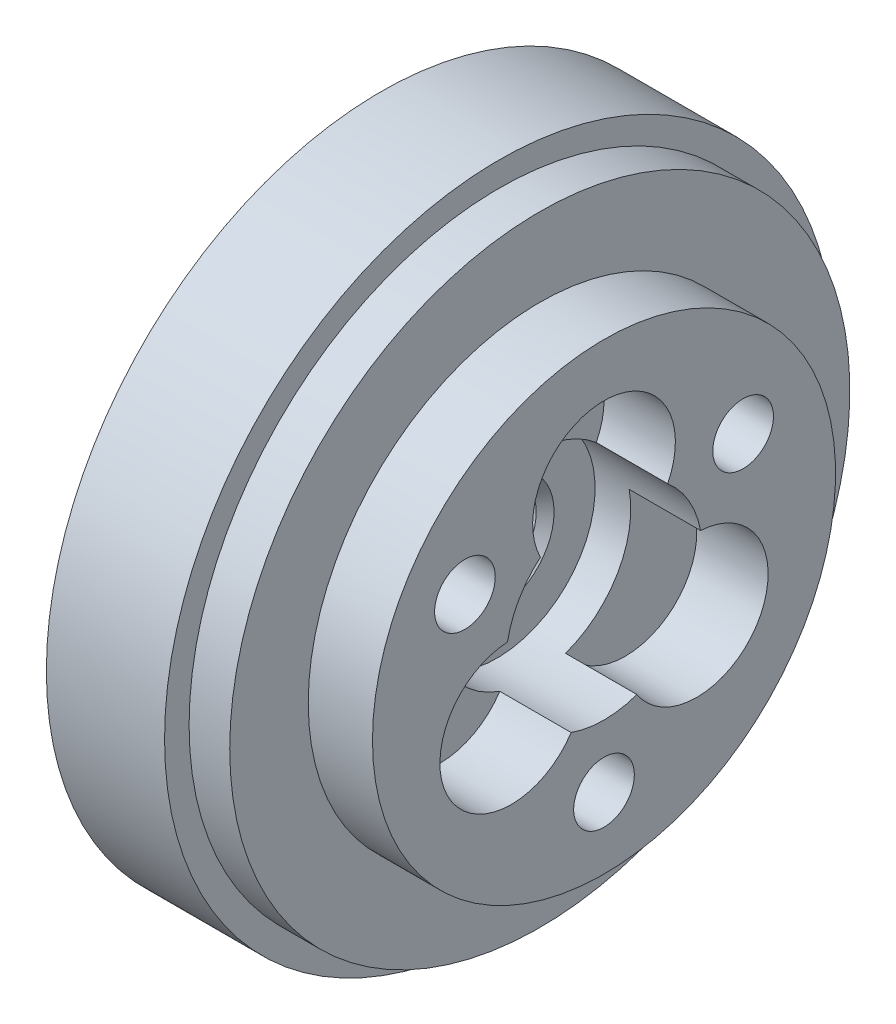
ISO-10303-21;
HEADER;
FILE_DESCRIPTION(('STEP AP214'),'2;1');
FILE_NAME('part.step','',(''),(''),'','','');
FILE_SCHEMA(('AUTOMOTIVE_DESIGN { 1 0 10303 214 1 1 1 1 }'));
ENDSEC;
DATA;
#1=APPLICATION_CONTEXT('core data for automotive mechanical design processes');
#2=APPLICATION_PROTOCOL_DEFINITION('international standard','automotive_design',2000,#1);
#3=PRODUCT_CONTEXT('',#1,'mechanical');
#4=PRODUCT('Part','Part','',(#3));
#5=PRODUCT_RELATED_PRODUCT_CATEGORY('part','',(#4));
#6=PRODUCT_DEFINITION_FORMATION('','',#4);
#7=PRODUCT_DEFINITION_CONTEXT('part definition',#1,'design');
#8=PRODUCT_DEFINITION('design','',#6,#7);
#9=PRODUCT_DEFINITION_SHAPE('','',#8);
#10=(LENGTH_UNIT() NAMED_UNIT(*) SI_UNIT(.MILLI.,.METRE.));
#11=(NAMED_UNIT(*) PLANE_ANGLE_UNIT() SI_UNIT($,.RADIAN.));
#12=(NAMED_UNIT(*) SI_UNIT($,.STERADIAN.) SOLID_ANGLE_UNIT());
#13=UNCERTAINTY_MEASURE_WITH_UNIT(LENGTH_MEASURE(1.E-05),#10,'distance_accuracy_value','');
#14=(GEOMETRIC_REPRESENTATION_CONTEXT(3) GLOBAL_UNCERTAINTY_ASSIGNED_CONTEXT((#13)) GLOBAL_UNIT_ASSIGNED_CONTEXT((#10,
#11,#12)) REPRESENTATION_CONTEXT('',''));
#15=CARTESIAN_POINT('',(0.,0.,0.));
#16=DIRECTION('',(0.,0.,1.));
#17=DIRECTION('',(1.,0.,0.));
#18=AXIS2_PLACEMENT_3D('',#15,#16,#17);
#19=CARTESIAN_POINT('',(0.,0.,0.));
#20=DIRECTION('',(1.,0.,0.));
#21=DIRECTION('',(0.,0.,-1.));
#22=AXIS2_PLACEMENT_3D('',#19,#20,#21);
#23=PLANE('',#22);
#24=CARTESIAN_POINT('',(0.,0.,0.));
#25=DIRECTION('',(1.,0.,0.));
#26=DIRECTION('',(0.,0.,-1.));
#27=AXIS2_PLACEMENT_3D('',#24,#25,#26);
#28=CIRCLE('',#27,2.21000000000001);
#29=CARTESIAN_POINT('',(0.,0.,-2.21000000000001));
#30=VERTEX_POINT('',#29);
#31=EDGE_CURVE('E166',#30,#30,#28,.T.);
#32=ORIENTED_EDGE('',*,*,#31,.T.);
#33=EDGE_LOOP('',(#32));
#34=FACE_BOUND('',#33,.T.);
#35=CARTESIAN_POINT('',(0.,0.,0.));
#36=DIRECTION('',(-1.,0.,0.));
#37=DIRECTION('',(0.,0.,1.));
#38=AXIS2_PLACEMENT_3D('',#35,#36,#37);
#39=CIRCLE('',#38,37.5);
#40=CARTESIAN_POINT('',(0.,0.,37.5));
#41=VERTEX_POINT('',#40);
#42=EDGE_CURVE('E154',#41,#41,#39,.T.);
#43=ORIENTED_EDGE('',*,*,#42,.T.);
#44=EDGE_LOOP('',(#43));
#45=FACE_BOUND('',#44,.T.);
#46=ADVANCED_FACE('F32',(#34,#45),#23,.F.);
#47=CARTESIAN_POINT('',(25.,25.95,0.));
#48=DIRECTION('',(-1.,0.,0.));
#49=DIRECTION('',(0.,0.,1.));
#50=AXIS2_PLACEMENT_3D('',#47,#48,#49);
#51=PLANE('',#50);
#52=CARTESIAN_POINT('',(25.,9.00000000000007,15.5884572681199));
#53=DIRECTION('',(1.,0.,0.));
#54=DIRECTION('',(0.,0.,-1.));
#55=AXIS2_PLACEMENT_3D('',#52,#53,#54);
#56=CIRCLE('',#55,3.4);
#57=CARTESIAN_POINT('',(25.,9.00000000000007,12.1884572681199));
#58=VERTEX_POINT('',#57);
#59=EDGE_CURVE('E100',#58,#58,#56,.T.);
#60=ORIENTED_EDGE('',*,*,#59,.F.);
#61=EDGE_LOOP('',(#60));
#62=FACE_BOUND('',#61,.T.);
#63=CARTESIAN_POINT('',(25.,8.99999999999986,-15.58845726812));
#64=DIRECTION('',(1.,0.,0.));
#65=DIRECTION('',(0.,0.,-1.));
#66=AXIS2_PLACEMENT_3D('',#63,#64,#65);
#67=CIRCLE('',#66,3.4);
#68=CARTESIAN_POINT('',(25.,8.99999999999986,-18.98845726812));
#69=VERTEX_POINT('',#68);
#70=EDGE_CURVE('E108',#69,#69,#67,.T.);
#71=ORIENTED_EDGE('',*,*,#70,.F.);
#72=EDGE_LOOP('',(#71));
#73=FACE_BOUND('',#72,.T.);
#74=CARTESIAN_POINT('',(25.,-18.,0.));
#75=DIRECTION('',(1.,0.,0.));
#76=DIRECTION('',(0.,0.,-1.));
#77=AXIS2_PLACEMENT_3D('',#74,#75,#76);
#78=CIRCLE('',#77,3.4);
#79=CARTESIAN_POINT('',(25.,-18.,-3.4));
#80=VERTEX_POINT('',#79);
#81=EDGE_CURVE('E114',#80,#80,#78,.T.);
#82=ORIENTED_EDGE('',*,*,#81,.F.);
#83=EDGE_LOOP('',(#82));
#84=FACE_BOUND('',#83,.T.);
#85=CARTESIAN_POINT('',(25.,0.,0.));
#86=DIRECTION('',(-1.,0.,0.));
#87=DIRECTION('',(0.,0.,1.));
#88=AXIS2_PLACEMENT_3D('',#85,#86,#87);
#89=CIRCLE('',#88,25.95);
#90=CARTESIAN_POINT('',(25.,0.,25.95));
#91=VERTEX_POINT('',#90);
#92=EDGE_CURVE('E139',#91,#91,#89,.T.);
#93=ORIENTED_EDGE('',*,*,#92,.F.);
#94=EDGE_LOOP('',(#93));
#95=FACE_BOUND('',#94,.T.);
#96=CARTESIAN_POINT('',(25.,0.,0.));
#97=DIRECTION('',(-1.,0.,0.));
#98=DIRECTION('',(0.,0.,1.));
#99=AXIS2_PLACEMENT_3D('',#96,#97,#98);
#100=CIRCLE('',#99,11.);
#101=CARTESIAN_POINT('',(25.,-10.3636259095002,-3.68717480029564));
#102=VERTEX_POINT('',#101);
#103=CARTESIAN_POINT('',(25.,-10.3636259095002,3.68717480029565));
#104=VERTEX_POINT('',#103);
#105=EDGE_CURVE('E133',#102,#104,#100,.T.);
#106=ORIENTED_EDGE('',*,*,#105,.T.);
#107=CARTESIAN_POINT('',(25.,-6.00000000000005,10.3923048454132));
#108=DIRECTION('',(1.,0.,0.));
#109=DIRECTION('',(0.,0.,-1.));
#110=AXIS2_PLACEMENT_3D('',#107,#108,#109);
#111=CIRCLE('',#110,8.);
#112=CARTESIAN_POINT('',(25.,1.98862590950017,10.8187507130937));
#113=VERTEX_POINT('',#112);
#114=EDGE_CURVE('E117',#113,#104,#111,.T.);
#115=ORIENTED_EDGE('',*,*,#114,.F.);
#116=CARTESIAN_POINT('',(25.,8.375,7.13157591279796));
#117=VERTEX_POINT('',#116);
#118=EDGE_CURVE('E126',#113,#117,#100,.T.);
#119=ORIENTED_EDGE('',*,*,#118,.T.);
#120=CARTESIAN_POINT('',(25.,12.,0.));
#121=DIRECTION('',(1.,0.,0.));
#122=DIRECTION('',(0.,0.,-1.));
#123=AXIS2_PLACEMENT_3D('',#120,#121,#122);
#124=CIRCLE('',#123,8.);
#125=CARTESIAN_POINT('',(25.,8.375,-7.13157591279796));
#126=VERTEX_POINT('',#125);
#127=EDGE_CURVE('E122',#126,#117,#124,.T.);
#128=ORIENTED_EDGE('',*,*,#127,.F.);
#129=CARTESIAN_POINT('',(25.,1.98862590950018,-10.8187507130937));
#130=VERTEX_POINT('',#129);
#131=EDGE_CURVE('E129',#126,#130,#100,.T.);
#132=ORIENTED_EDGE('',*,*,#131,.T.);
#133=CARTESIAN_POINT('',(25.,-6.00000000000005,-10.3923048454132));
#134=DIRECTION('',(1.,0.,0.));
#135=DIRECTION('',(0.,0.,-1.));
#136=AXIS2_PLACEMENT_3D('',#133,#134,#135);
#137=CIRCLE('',#136,8.00000000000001);
#138=EDGE_CURVE('E119',#102,#130,#137,.T.);
#139=ORIENTED_EDGE('',*,*,#138,.F.);
#140=EDGE_LOOP('',(#106,#115,#119,#128,#132,#139));
#141=FACE_BOUND('',#140,.T.);
#142=ADVANCED_FACE('F217',(#62,#73,#84,#95,#141),#51,.F.);
#143=CARTESIAN_POINT('',(0.,0.,0.));
#144=DIRECTION('',(-1.,0.,0.));
#145=DIRECTION('',(0.,0.,1.));
#146=AXIS2_PLACEMENT_3D('',#143,#144,#145);
#147=CYLINDRICAL_SURFACE('',#146,37.5);
#148=ORIENTED_EDGE('',*,*,#42,.F.);
#149=EDGE_LOOP('',(#148));
#150=FACE_BOUND('',#149,.T.);
#151=CARTESIAN_POINT('',(13.2459946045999,0.,0.));
#152=DIRECTION('',(-1.,0.,0.));
#153=DIRECTION('',(0.,0.,1.));
#154=AXIS2_PLACEMENT_3D('',#151,#152,#153);
#155=CIRCLE('',#154,37.5);
#156=CARTESIAN_POINT('',(13.2459946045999,0.,37.5));
#157=VERTEX_POINT('',#156);
#158=EDGE_CURVE('E151',#157,#157,#155,.T.);
#159=ORIENTED_EDGE('',*,*,#158,.T.);
#160=EDGE_LOOP('',(#159));
#161=FACE_BOUND('',#160,.T.);
#162=ADVANCED_FACE('F223',(#150,#161),#147,.T.);
#163=CARTESIAN_POINT('',(13.2459946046,37.5,0.));
#164=DIRECTION('',(-1.,0.,0.));
#165=DIRECTION('',(0.,0.,1.));
#166=AXIS2_PLACEMENT_3D('',#163,#164,#165);
#167=PLANE('',#166);
#168=ORIENTED_EDGE('',*,*,#158,.F.);
#169=EDGE_LOOP('',(#168));
#170=FACE_BOUND('',#169,.T.);
#171=CARTESIAN_POINT('',(13.2459946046,0.,0.));
#172=DIRECTION('',(-1.,0.,0.));
#173=DIRECTION('',(0.,0.,1.));
#174=AXIS2_PLACEMENT_3D('',#171,#172,#173);
#175=CIRCLE('',#174,34.75);
#176=CARTESIAN_POINT('',(13.2459946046,0.,34.75));
#177=VERTEX_POINT('',#176);
#178=EDGE_CURVE('E148',#177,#177,#175,.T.);
#179=ORIENTED_EDGE('',*,*,#178,.T.);
#180=EDGE_LOOP('',(#179));
#181=FACE_BOUND('',#180,.T.);
#182=ADVANCED_FACE('F268',(#170,#181),#167,.F.);
#183=CARTESIAN_POINT('',(0.,0.,0.));
#184=DIRECTION('',(-1.,0.,0.));
#185=DIRECTION('',(0.,0.,1.));
#186=AXIS2_PLACEMENT_3D('',#183,#184,#185);
#187=CYLINDRICAL_SURFACE('',#186,34.75);
#188=ORIENTED_EDGE('',*,*,#178,.F.);
#189=EDGE_LOOP('',(#188));
#190=FACE_BOUND('',#189,.T.);
#191=CARTESIAN_POINT('',(17.8,0.,0.));
#192=DIRECTION('',(-1.,0.,0.));
#193=DIRECTION('',(0.,0.,1.));
#194=AXIS2_PLACEMENT_3D('',#191,#192,#193);
#195=CIRCLE('',#194,34.75);
#196=CARTESIAN_POINT('',(17.8,0.,34.75));
#197=VERTEX_POINT('',#196);
#198=EDGE_CURVE('E145',#197,#197,#195,.T.);
#199=ORIENTED_EDGE('',*,*,#198,.T.);
#200=EDGE_LOOP('',(#199));
#201=FACE_BOUND('',#200,.T.);
#202=ADVANCED_FACE('F265',(#190,#201),#187,.T.);
#203=CARTESIAN_POINT('',(17.8,34.75,0.));
#204=DIRECTION('',(-1.,0.,0.));
#205=DIRECTION('',(0.,0.,1.));
#206=AXIS2_PLACEMENT_3D('',#203,#204,#205);
#207=PLANE('',#206);
#208=ORIENTED_EDGE('',*,*,#198,.F.);
#209=EDGE_LOOP('',(#208));
#210=FACE_BOUND('',#209,.T.);
#211=CARTESIAN_POINT('',(17.8,0.,0.));
#212=DIRECTION('',(-1.,0.,0.));
#213=DIRECTION('',(0.,0.,1.));
#214=AXIS2_PLACEMENT_3D('',#211,#212,#213);
#215=CIRCLE('',#214,25.95);
#216=CARTESIAN_POINT('',(17.8,0.,25.95));
#217=VERTEX_POINT('',#216);
#218=EDGE_CURVE('E142',#217,#217,#215,.T.);
#219=ORIENTED_EDGE('',*,*,#218,.T.);
#220=EDGE_LOOP('',(#219));
#221=FACE_BOUND('',#220,.T.);
#222=ADVANCED_FACE('F258',(#210,#221),#207,.F.);
#223=CARTESIAN_POINT('',(0.,0.,0.));
#224=DIRECTION('',(-1.,0.,0.));
#225=DIRECTION('',(0.,0.,1.));
#226=AXIS2_PLACEMENT_3D('',#223,#224,#225);
#227=CYLINDRICAL_SURFACE('',#226,25.95);
#228=ORIENTED_EDGE('',*,*,#218,.F.);
#229=EDGE_LOOP('',(#228));
#230=FACE_BOUND('',#229,.T.);
#231=ORIENTED_EDGE('',*,*,#92,.T.);
#232=EDGE_LOOP('',(#231));
#233=FACE_BOUND('',#232,.T.);
#234=ADVANCED_FACE('F248',(#230,#233),#227,.T.);
#235=CARTESIAN_POINT('',(0.,0.,0.));
#236=DIRECTION('',(-1.,0.,0.));
#237=DIRECTION('',(0.,0.,1.));
#238=AXIS2_PLACEMENT_3D('',#235,#236,#237);
#239=CYLINDRICAL_SURFACE('',#238,2.01);
#240=CARTESIAN_POINT('',(5.8,0.,0.));
#241=DIRECTION('',(1.,0.,0.));
#242=DIRECTION('',(0.,0.,-1.));
#243=AXIS2_PLACEMENT_3D('',#240,#241,#242);
#244=CIRCLE('',#243,2.01);
#245=CARTESIAN_POINT('',(5.8,0.,-2.01));
#246=VERTEX_POINT('',#245);
#247=EDGE_CURVE('E163',#246,#246,#244,.T.);
#248=ORIENTED_EDGE('',*,*,#247,.T.);
#249=EDGE_LOOP('',(#248));
#250=FACE_BOUND('',#249,.T.);
#251=CARTESIAN_POINT('',(0.200000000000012,0.,0.));
#252=DIRECTION('',(1.,0.,0.));
#253=DIRECTION('',(0.,0.,-1.));
#254=AXIS2_PLACEMENT_3D('',#251,#252,#253);
#255=CIRCLE('',#254,2.01);
#256=CARTESIAN_POINT('',(0.200000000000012,0.,-2.01));
#257=VERTEX_POINT('',#256);
#258=EDGE_CURVE('E160',#257,#257,#255,.F.);
#259=ORIENTED_EDGE('',*,*,#258,.T.);
#260=EDGE_LOOP('',(#259));
#261=FACE_BOUND('',#260,.T.);
#262=ADVANCED_FACE('F245',(#250,#261),#239,.F.);
#263=CARTESIAN_POINT('',(6.,2.01,0.));
#264=DIRECTION('',(1.,0.,0.));
#265=DIRECTION('',(0.,0.,-1.));
#266=AXIS2_PLACEMENT_3D('',#263,#264,#265);
#267=PLANE('',#266);
#268=CARTESIAN_POINT('',(6.,0.,0.));
#269=DIRECTION('',(1.,0.,0.));
#270=DIRECTION('',(0.,0.,-1.));
#271=AXIS2_PLACEMENT_3D('',#268,#269,#270);
#272=CIRCLE('',#271,2.21);
#273=CARTESIAN_POINT('',(6.,0.,-2.21));
#274=VERTEX_POINT('',#273);
#275=EDGE_CURVE('E157',#274,#274,#272,.F.);
#276=ORIENTED_EDGE('',*,*,#275,.T.);
#277=EDGE_LOOP('',(#276));
#278=FACE_BOUND('',#277,.T.);
#279=CARTESIAN_POINT('',(6.,0.,0.));
#280=DIRECTION('',(-1.,0.,0.));
#281=DIRECTION('',(0.,0.,1.));
#282=AXIS2_PLACEMENT_3D('',#279,#280,#281);
#283=CIRCLE('',#282,5.4);
#284=CARTESIAN_POINT('',(6.,0.,5.4));
#285=VERTEX_POINT('',#284);
#286=EDGE_CURVE('E136',#285,#285,#283,.T.);
#287=ORIENTED_EDGE('',*,*,#286,.F.);
#288=EDGE_LOOP('',(#287));
#289=FACE_BOUND('',#288,.T.);
#290=ADVANCED_FACE('F247',(#278,#289),#267,.T.);
#291=CARTESIAN_POINT('',(0.,0.,0.));
#292=DIRECTION('',(-1.,0.,0.));
#293=DIRECTION('',(0.,0.,1.));
#294=AXIS2_PLACEMENT_3D('',#291,#292,#293);
#295=CYLINDRICAL_SURFACE('',#294,5.4);
#296=CARTESIAN_POINT('',(12.,0.,0.));
#297=DIRECTION('',(1.,0.,0.));
#298=DIRECTION('',(0.,0.,-1.));
#299=AXIS2_PLACEMENT_3D('',#296,#297,#298);
#300=CIRCLE('',#299,5.4);
#301=CARTESIAN_POINT('',(12.,0.,-5.4));
#302=VERTEX_POINT('',#301);
#303=EDGE_CURVE('E172',#302,#302,#300,.T.);
#304=ORIENTED_EDGE('',*,*,#303,.T.);
#305=EDGE_LOOP('',(#304));
#306=FACE_BOUND('',#305,.T.);
#307=ORIENTED_EDGE('',*,*,#286,.T.);
#308=EDGE_LOOP('',(#307));
#309=FACE_BOUND('',#308,.T.);
#310=ADVANCED_FACE('F255',(#306,#309),#295,.F.);
#311=CARTESIAN_POINT('',(13.,5.4,0.));
#312=DIRECTION('',(1.,0.,0.));
#313=DIRECTION('',(0.,0.,-1.));
#314=AXIS2_PLACEMENT_3D('',#311,#312,#313);
#315=PLANE('',#314);
#316=CARTESIAN_POINT('',(13.,0.,0.));
#317=DIRECTION('',(1.,0.,0.));
#318=DIRECTION('',(0.,0.,-1.));
#319=AXIS2_PLACEMENT_3D('',#316,#317,#318);
#320=CIRCLE('',#319,6.40000000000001);
#321=CARTESIAN_POINT('',(13.,0.,-6.40000000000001));
#322=VERTEX_POINT('',#321);
#323=EDGE_CURVE('E169',#322,#322,#320,.F.);
#324=ORIENTED_EDGE('',*,*,#323,.T.);
#325=EDGE_LOOP('',(#324));
#326=FACE_BOUND('',#325,.T.);
#327=CARTESIAN_POINT('',(13.,0.,0.));
#328=DIRECTION('',(-1.,0.,0.));
#329=DIRECTION('',(0.,0.,1.));
#330=AXIS2_PLACEMENT_3D('',#327,#328,#329);
#331=CIRCLE('',#330,11.);
#332=CARTESIAN_POINT('',(13.,0.,11.));
#333=VERTEX_POINT('',#332);
#334=EDGE_CURVE('E132',#333,#333,#331,.T.);
#335=ORIENTED_EDGE('',*,*,#334,.F.);
#336=EDGE_LOOP('',(#335));
#337=FACE_BOUND('',#336,.T.);
#338=ADVANCED_FACE('F311',(#326,#337),#315,.T.);
#339=CARTESIAN_POINT('',(0.,0.,0.));
#340=DIRECTION('',(-1.,0.,0.));
#341=DIRECTION('',(0.,0.,1.));
#342=AXIS2_PLACEMENT_3D('',#339,#340,#341);
#343=CYLINDRICAL_SURFACE('',#342,11.);
#344=DIRECTION('',(1.,0.,0.));
#345=VECTOR('',#344,1.);
#346=CARTESIAN_POINT('',(21.,1.98862590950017,10.8187507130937));
#347=LINE('',#346,#345);
#348=CARTESIAN_POINT('',(17.,1.98862590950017,10.8187507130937));
#349=VERTEX_POINT('',#348);
#350=EDGE_CURVE('E11',#349,#113,#347,.T.);
#351=ORIENTED_EDGE('',*,*,#350,.F.);
#352=CARTESIAN_POINT('',(17.,0.,0.));
#353=DIRECTION('',(1.,0.,0.));
#354=DIRECTION('',(0.,0.,-1.));
#355=AXIS2_PLACEMENT_3D('',#352,#353,#354);
#356=CIRCLE('',#355,11.);
#357=CARTESIAN_POINT('',(17.,-10.3636259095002,3.68717480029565));
#358=VERTEX_POINT('',#357);
#359=EDGE_CURVE('E190',#349,#358,#356,.T.);
#360=ORIENTED_EDGE('',*,*,#359,.T.);
#361=DIRECTION('',(1.,0.,0.));
#362=VECTOR('',#361,1.);
#363=CARTESIAN_POINT('',(21.,-10.3636259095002,3.68717480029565));
#364=LINE('',#363,#362);
#365=EDGE_CURVE('E40',#104,#358,#364,.F.);
#366=ORIENTED_EDGE('',*,*,#365,.F.);
#367=ORIENTED_EDGE('',*,*,#105,.F.);
#368=DIRECTION('',(1.,0.,0.));
#369=VECTOR('',#368,1.);
#370=CARTESIAN_POINT('',(21.,-10.3636259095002,-3.68717480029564));
#371=LINE('',#370,#369);
#372=CARTESIAN_POINT('',(17.,-10.3636259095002,-3.68717480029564));
#373=VERTEX_POINT('',#372);
#374=EDGE_CURVE('E188',#373,#102,#371,.T.);
#375=ORIENTED_EDGE('',*,*,#374,.F.);
#376=CARTESIAN_POINT('',(17.,0.,0.));
#377=DIRECTION('',(1.,0.,0.));
#378=DIRECTION('',(0.,0.,-1.));
#379=AXIS2_PLACEMENT_3D('',#376,#377,#378);
#380=CIRCLE('',#379,11.);
#381=CARTESIAN_POINT('',(17.,1.98862590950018,-10.8187507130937));
#382=VERTEX_POINT('',#381);
#383=EDGE_CURVE('E183',#373,#382,#380,.T.);
#384=ORIENTED_EDGE('',*,*,#383,.T.);
#385=DIRECTION('',(1.,0.,0.));
#386=VECTOR('',#385,1.);
#387=CARTESIAN_POINT('',(21.,1.98862590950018,-10.8187507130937));
#388=LINE('',#387,#386);
#389=EDGE_CURVE('E186',#130,#382,#388,.F.);
#390=ORIENTED_EDGE('',*,*,#389,.F.);
#391=ORIENTED_EDGE('',*,*,#131,.F.);
#392=DIRECTION('',(1.,0.,0.));
#393=VECTOR('',#392,1.);
#394=CARTESIAN_POINT('',(21.,8.375,-7.13157591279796));
#395=LINE('',#394,#393);
#396=CARTESIAN_POINT('',(17.,8.375,-7.13157591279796));
#397=VERTEX_POINT('',#396);
#398=EDGE_CURVE('E181',#397,#126,#395,.T.);
#399=ORIENTED_EDGE('',*,*,#398,.F.);
#400=CARTESIAN_POINT('',(17.,0.,0.));
#401=DIRECTION('',(1.,0.,0.));
#402=DIRECTION('',(0.,0.,-1.));
#403=AXIS2_PLACEMENT_3D('',#400,#401,#402);
#404=CIRCLE('',#403,11.);
#405=CARTESIAN_POINT('',(17.,8.375,7.13157591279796));
#406=VERTEX_POINT('',#405);
#407=EDGE_CURVE('E175',#397,#406,#404,.T.);
#408=ORIENTED_EDGE('',*,*,#407,.T.);
#409=DIRECTION('',(1.,0.,0.));
#410=VECTOR('',#409,1.);
#411=CARTESIAN_POINT('',(21.,8.375,7.13157591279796));
#412=LINE('',#411,#410);
#413=EDGE_CURVE('E178',#117,#406,#412,.F.);
#414=ORIENTED_EDGE('',*,*,#413,.F.);
#415=ORIENTED_EDGE('',*,*,#118,.F.);
#416=EDGE_LOOP('',(#351,#360,#366,#367,#375,#384,#390,#391,#399,#408,#414,#415));
#417=FACE_BOUND('',#416,.T.);
#418=ORIENTED_EDGE('',*,*,#334,.T.);
#419=EDGE_LOOP('',(#418));
#420=FACE_BOUND('',#419,.T.);
#421=ADVANCED_FACE('F200',(#417,#420),#343,.F.);
#422=CARTESIAN_POINT('',(6.,0.,0.));
#423=DIRECTION('',(1.,0.,0.));
#424=DIRECTION('',(0.,0.,-1.));
#425=AXIS2_PLACEMENT_3D('',#422,#423,#424);
#426=CONICAL_SURFACE('',#425,2.21,0.785398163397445);
#427=ORIENTED_EDGE('',*,*,#247,.F.);
#428=EDGE_LOOP('',(#427));
#429=FACE_BOUND('',#428,.T.);
#430=ORIENTED_EDGE('',*,*,#275,.F.);
#431=EDGE_LOOP('',(#430));
#432=FACE_BOUND('',#431,.T.);
#433=ADVANCED_FACE('F230',(#429,#432),#426,.F.);
#434=CARTESIAN_POINT('',(0.200000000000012,0.,0.));
#435=DIRECTION('',(-1.,0.,0.));
#436=DIRECTION('',(0.,0.,1.));
#437=AXIS2_PLACEMENT_3D('',#434,#435,#436);
#438=CONICAL_SURFACE('',#437,2.01,0.785398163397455);
#439=ORIENTED_EDGE('',*,*,#31,.F.);
#440=EDGE_LOOP('',(#439));
#441=FACE_BOUND('',#440,.T.);
#442=ORIENTED_EDGE('',*,*,#258,.F.);
#443=EDGE_LOOP('',(#442));
#444=FACE_BOUND('',#443,.T.);
#445=ADVANCED_FACE('F232',(#441,#444),#438,.F.);
#446=CARTESIAN_POINT('',(13.,0.,0.));
#447=DIRECTION('',(1.,0.,0.));
#448=DIRECTION('',(0.,0.,-1.));
#449=AXIS2_PLACEMENT_3D('',#446,#447,#448);
#450=CONICAL_SURFACE('',#449,6.40000000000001,0.785398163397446);
#451=ORIENTED_EDGE('',*,*,#303,.F.);
#452=EDGE_LOOP('',(#451));
#453=FACE_BOUND('',#452,.T.);
#454=ORIENTED_EDGE('',*,*,#323,.F.);
#455=EDGE_LOOP('',(#454));
#456=FACE_BOUND('',#455,.T.);
#457=ADVANCED_FACE('F34',(#453,#456),#450,.F.);
#458=CARTESIAN_POINT('',(17.,12.,0.));
#459=DIRECTION('',(1.,0.,0.));
#460=DIRECTION('',(0.,0.,-1.));
#461=AXIS2_PLACEMENT_3D('',#458,#459,#460);
#462=CYLINDRICAL_SURFACE('',#461,8.);
#463=ORIENTED_EDGE('',*,*,#398,.T.);
#464=ORIENTED_EDGE('',*,*,#127,.T.);
#465=ORIENTED_EDGE('',*,*,#413,.T.);
#466=CARTESIAN_POINT('',(17.,12.,0.));
#467=DIRECTION('',(1.,0.,0.));
#468=DIRECTION('',(0.,0.,-1.));
#469=AXIS2_PLACEMENT_3D('',#466,#467,#468);
#470=CIRCLE('',#469,8.);
#471=EDGE_CURVE('E124',#397,#406,#470,.T.);
#472=ORIENTED_EDGE('',*,*,#471,.F.);
#473=EDGE_LOOP('',(#463,#464,#465,#472));
#474=FACE_BOUND('',#473,.T.);
#475=ADVANCED_FACE('F239',(#474),#462,.F.);
#476=CARTESIAN_POINT('',(17.,12.,0.));
#477=DIRECTION('',(1.,0.,0.));
#478=DIRECTION('',(0.,0.,-1.));
#479=AXIS2_PLACEMENT_3D('',#476,#477,#478);
#480=PLANE('',#479);
#481=ORIENTED_EDGE('',*,*,#471,.T.);
#482=ORIENTED_EDGE('',*,*,#407,.F.);
#483=EDGE_LOOP('',(#481,#482));
#484=FACE_BOUND('',#483,.T.);
#485=ADVANCED_FACE('F296',(#484),#480,.T.);
#486=CARTESIAN_POINT('',(17.,-6.00000000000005,-10.3923048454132));
#487=DIRECTION('',(1.,0.,0.));
#488=DIRECTION('',(0.,0.,-1.));
#489=AXIS2_PLACEMENT_3D('',#486,#487,#488);
#490=CYLINDRICAL_SURFACE('',#489,8.00000000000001);
#491=ORIENTED_EDGE('',*,*,#374,.T.);
#492=ORIENTED_EDGE('',*,*,#138,.T.);
#493=ORIENTED_EDGE('',*,*,#389,.T.);
#494=CARTESIAN_POINT('',(17.,-6.00000000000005,-10.3923048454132));
#495=DIRECTION('',(1.,0.,0.));
#496=DIRECTION('',(0.,0.,-1.));
#497=AXIS2_PLACEMENT_3D('',#494,#495,#496);
#498=CIRCLE('',#497,8.00000000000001);
#499=EDGE_CURVE('E53',#373,#382,#498,.T.);
#500=ORIENTED_EDGE('',*,*,#499,.F.);
#501=EDGE_LOOP('',(#491,#492,#493,#500));
#502=FACE_BOUND('',#501,.T.);
#503=ADVANCED_FACE('F298',(#502),#490,.F.);
#504=CARTESIAN_POINT('',(17.,-6.00000000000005,-10.3923048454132));
#505=DIRECTION('',(1.,0.,0.));
#506=DIRECTION('',(0.,0.,-1.));
#507=AXIS2_PLACEMENT_3D('',#504,#505,#506);
#508=PLANE('',#507);
#509=ORIENTED_EDGE('',*,*,#499,.T.);
#510=ORIENTED_EDGE('',*,*,#383,.F.);
#511=EDGE_LOOP('',(#509,#510));
#512=FACE_BOUND('',#511,.T.);
#513=ADVANCED_FACE('F214',(#512),#508,.T.);
#514=CARTESIAN_POINT('',(17.,-6.00000000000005,10.3923048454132));
#515=DIRECTION('',(1.,0.,0.));
#516=DIRECTION('',(0.,0.,-1.));
#517=AXIS2_PLACEMENT_3D('',#514,#515,#516);
#518=CYLINDRICAL_SURFACE('',#517,8.);
#519=ORIENTED_EDGE('',*,*,#350,.T.);
#520=ORIENTED_EDGE('',*,*,#114,.T.);
#521=ORIENTED_EDGE('',*,*,#365,.T.);
#522=CARTESIAN_POINT('',(17.,-6.00000000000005,10.3923048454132));
#523=DIRECTION('',(1.,0.,0.));
#524=DIRECTION('',(0.,0.,-1.));
#525=AXIS2_PLACEMENT_3D('',#522,#523,#524);
#526=CIRCLE('',#525,8.);
#527=EDGE_CURVE('E46',#349,#358,#526,.T.);
#528=ORIENTED_EDGE('',*,*,#527,.F.);
#529=EDGE_LOOP('',(#519,#520,#521,#528));
#530=FACE_BOUND('',#529,.T.);
#531=ADVANCED_FACE('F194',(#530),#518,.F.);
#532=CARTESIAN_POINT('',(17.,-6.00000000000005,10.3923048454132));
#533=DIRECTION('',(1.,0.,0.));
#534=DIRECTION('',(0.,0.,-1.));
#535=AXIS2_PLACEMENT_3D('',#532,#533,#534);
#536=PLANE('',#535);
#537=ORIENTED_EDGE('',*,*,#527,.T.);
#538=ORIENTED_EDGE('',*,*,#359,.F.);
#539=EDGE_LOOP('',(#537,#538));
#540=FACE_BOUND('',#539,.T.);
#541=ADVANCED_FACE('F203',(#540),#536,.T.);
#542=CARTESIAN_POINT('',(25.,-18.,0.));
#543=DIRECTION('',(1.,0.,0.));
#544=DIRECTION('',(0.,0.,-1.));
#545=AXIS2_PLACEMENT_3D('',#542,#543,#544);
#546=CYLINDRICAL_SURFACE('',#545,3.4);
#547=CARTESIAN_POINT('',(11.25,-18.,0.));
#548=DIRECTION('',(1.,0.,0.));
#549=DIRECTION('',(0.,0.,-1.));
#550=AXIS2_PLACEMENT_3D('',#547,#548,#549);
#551=CIRCLE('',#550,3.4);
#552=CARTESIAN_POINT('',(11.25,-18.,-3.4));
#553=VERTEX_POINT('',#552);
#554=EDGE_CURVE('E111',#553,#553,#551,.T.);
#555=ORIENTED_EDGE('',*,*,#554,.F.);
#556=EDGE_LOOP('',(#555));
#557=FACE_BOUND('',#556,.T.);
#558=ORIENTED_EDGE('',*,*,#81,.T.);
#559=EDGE_LOOP('',(#558));
#560=FACE_BOUND('',#559,.T.);
#561=ADVANCED_FACE('F205',(#557,#560),#546,.F.);
#562=CARTESIAN_POINT('',(11.25,-18.,0.));
#563=DIRECTION('',(1.,0.,0.));
#564=DIRECTION('',(0.,0.,-1.));
#565=AXIS2_PLACEMENT_3D('',#562,#563,#564);
#566=CONICAL_SURFACE('',#565,3.4,1.02974425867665);
#567=CARTESIAN_POINT('',(9.2070738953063,-18.,0.));
#568=VERTEX_POINT('',#567);
#569=VERTEX_LOOP('',#568);
#570=FACE_BOUND('',#569,.T.);
#571=ORIENTED_EDGE('',*,*,#554,.T.);
#572=EDGE_LOOP('',(#571));
#573=FACE_BOUND('',#572,.T.);
#574=ADVANCED_FACE('F211',(#570,#573),#566,.F.);
#575=CARTESIAN_POINT('',(25.,8.99999999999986,-15.58845726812));
#576=DIRECTION('',(1.,0.,0.));
#577=DIRECTION('',(0.,0.,-1.));
#578=AXIS2_PLACEMENT_3D('',#575,#576,#577);
#579=CYLINDRICAL_SURFACE('',#578,3.4);
#580=CARTESIAN_POINT('',(11.25,8.99999999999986,-15.58845726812));
#581=DIRECTION('',(1.,0.,0.));
#582=DIRECTION('',(0.,0.,-1.));
#583=AXIS2_PLACEMENT_3D('',#580,#581,#582);
#584=CIRCLE('',#583,3.4);
#585=CARTESIAN_POINT('',(11.25,8.99999999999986,-18.98845726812));
#586=VERTEX_POINT('',#585);
#587=EDGE_CURVE('E103',#586,#586,#584,.T.);
#588=ORIENTED_EDGE('',*,*,#587,.F.);
#589=EDGE_LOOP('',(#588));
#590=FACE_BOUND('',#589,.T.);
#591=ORIENTED_EDGE('',*,*,#70,.T.);
#592=EDGE_LOOP('',(#591));
#593=FACE_BOUND('',#592,.T.);
#594=ADVANCED_FACE('F397',(#590,#593),#579,.F.);
#595=CARTESIAN_POINT('',(11.25,8.99999999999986,-15.58845726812));
#596=DIRECTION('',(1.,0.,0.));
#597=DIRECTION('',(0.,0.,-1.));
#598=AXIS2_PLACEMENT_3D('',#595,#596,#597);
#599=CONICAL_SURFACE('',#598,3.4,1.02974425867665);
#600=CARTESIAN_POINT('',(9.2070738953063,8.99999999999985,-15.58845726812));
#601=VERTEX_POINT('',#600);
#602=VERTEX_LOOP('',#601);
#603=FACE_BOUND('',#602,.T.);
#604=ORIENTED_EDGE('',*,*,#587,.T.);
#605=EDGE_LOOP('',(#604));
#606=FACE_BOUND('',#605,.T.);
#607=ADVANCED_FACE('F406',(#603,#606),#599,.F.);
#608=CARTESIAN_POINT('',(25.,9.00000000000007,15.5884572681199));
#609=DIRECTION('',(1.,0.,0.));
#610=DIRECTION('',(0.,0.,-1.));
#611=AXIS2_PLACEMENT_3D('',#608,#609,#610);
#612=CYLINDRICAL_SURFACE('',#611,3.4);
#613=CARTESIAN_POINT('',(11.25,9.00000000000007,15.5884572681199));
#614=DIRECTION('',(1.,0.,0.));
#615=DIRECTION('',(0.,0.,-1.));
#616=AXIS2_PLACEMENT_3D('',#613,#614,#615);
#617=CIRCLE('',#616,3.4);
#618=CARTESIAN_POINT('',(11.25,9.00000000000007,12.1884572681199));
#619=VERTEX_POINT('',#618);
#620=EDGE_CURVE('E98',#619,#619,#617,.T.);
#621=ORIENTED_EDGE('',*,*,#620,.F.);
#622=EDGE_LOOP('',(#621));
#623=FACE_BOUND('',#622,.T.);
#624=ORIENTED_EDGE('',*,*,#59,.T.);
#625=EDGE_LOOP('',(#624));
#626=FACE_BOUND('',#625,.T.);
#627=ADVANCED_FACE('F94',(#623,#626),#612,.F.);
#628=CARTESIAN_POINT('',(11.25,9.00000000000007,15.5884572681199));
#629=DIRECTION('',(1.,0.,0.));
#630=DIRECTION('',(0.,0.,-1.));
#631=AXIS2_PLACEMENT_3D('',#628,#629,#630);
#632=CONICAL_SURFACE('',#631,3.4,1.02974425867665);
#633=CARTESIAN_POINT('',(9.2070738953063,9.00000000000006,15.5884572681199));
#634=VERTEX_POINT('',#633);
#635=VERTEX_LOOP('',#634);
#636=FACE_BOUND('',#635,.T.);
#637=ORIENTED_EDGE('',*,*,#620,.T.);
#638=EDGE_LOOP('',(#637));
#639=FACE_BOUND('',#638,.T.);
#640=ADVANCED_FACE('F91',(#636,#639),#632,.F.);
#641=CLOSED_SHELL('',(#46,#142,#162,#182,#202,#222,#234,#262,#290,#310,#338,#421,#433,#445,#457,
#475,#485,#503,#513,#531,#541,#561,#574,#594,#607,#627,#640));
#642=MANIFOLD_SOLID_BREP('B2',#641);
#643=ADVANCED_BREP_SHAPE_REPRESENTATION('',(#18,#642),#14);
#644=SHAPE_DEFINITION_REPRESENTATION(#9,#643);
ENDSEC;
END-ISO-10303-21;
